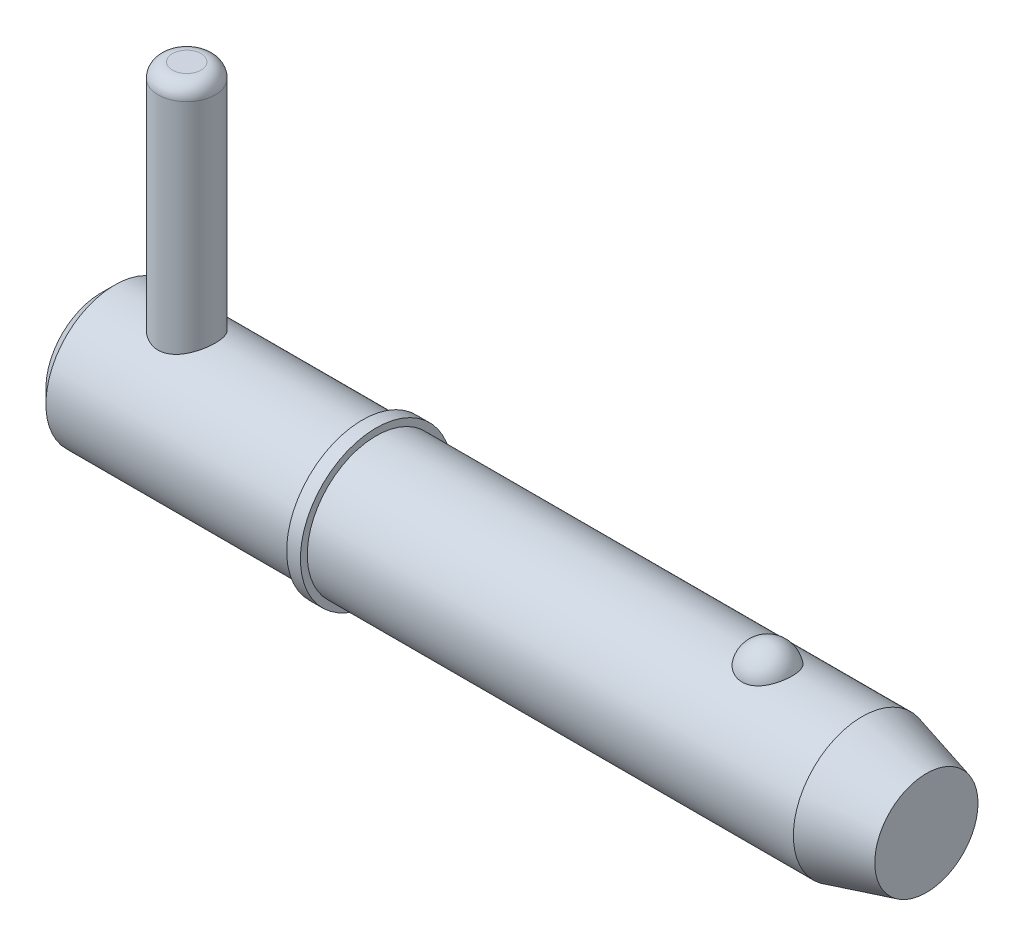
ISO-10303-21;
HEADER;
FILE_DESCRIPTION(('STEP AP214'),'2;1');
FILE_NAME('part.step','',(''),(''),'','','');
FILE_SCHEMA(('AUTOMOTIVE_DESIGN { 1 0 10303 214 1 1 1 1 }'));
ENDSEC;
DATA;
#1=APPLICATION_CONTEXT('core data for automotive mechanical design processes');
#2=APPLICATION_PROTOCOL_DEFINITION('international standard','automotive_design',2000,#1);
#3=PRODUCT_CONTEXT('',#1,'mechanical');
#4=PRODUCT('Part','Part','',(#3));
#5=PRODUCT_RELATED_PRODUCT_CATEGORY('part','',(#4));
#6=PRODUCT_DEFINITION_FORMATION('','',#4);
#7=PRODUCT_DEFINITION_CONTEXT('part definition',#1,'design');
#8=PRODUCT_DEFINITION('design','',#6,#7);
#9=PRODUCT_DEFINITION_SHAPE('','',#8);
#10=(LENGTH_UNIT() NAMED_UNIT(*) SI_UNIT(.MILLI.,.METRE.));
#11=(NAMED_UNIT(*) PLANE_ANGLE_UNIT() SI_UNIT($,.RADIAN.));
#12=(NAMED_UNIT(*) SI_UNIT($,.STERADIAN.) SOLID_ANGLE_UNIT());
#13=UNCERTAINTY_MEASURE_WITH_UNIT(LENGTH_MEASURE(1.E-05),#10,'distance_accuracy_value','');
#14=(GEOMETRIC_REPRESENTATION_CONTEXT(3) GLOBAL_UNCERTAINTY_ASSIGNED_CONTEXT((#13)) GLOBAL_UNIT_ASSIGNED_CONTEXT((#10,
#11,#12)) REPRESENTATION_CONTEXT('',''));
#15=CARTESIAN_POINT('',(0.,0.,0.));
#16=DIRECTION('',(0.,0.,1.));
#17=DIRECTION('',(1.,0.,0.));
#18=AXIS2_PLACEMENT_3D('',#15,#16,#17);
#19=CARTESIAN_POINT('',(5.94,20.635,0.));
#20=DIRECTION('',(0.,-1.,0.));
#21=DIRECTION('',(0.,0.,-1.));
#22=AXIS2_PLACEMENT_3D('',#19,#20,#21);
#23=CYLINDRICAL_SURFACE('',#22,1.98);
#24=CARTESIAN_POINT('',(5.94,-3.775,0.));
#25=DIRECTION('',(0.,1.,0.));
#26=DIRECTION('',(0.,0.,1.));
#27=AXIS2_PLACEMENT_3D('',#24,#25,#26);
#28=CIRCLE('',#27,1.98);
#29=CARTESIAN_POINT('',(5.94,-3.775,1.98));
#30=VERTEX_POINT('',#29);
#31=EDGE_CURVE('P0_E25',#30,#30,#28,.T.);
#32=ORIENTED_EDGE('',*,*,#31,.T.);
#33=EDGE_LOOP('',(#32));
#34=FACE_BOUND('',#33,.T.);
#35=CARTESIAN_POINT('',(5.94,19.645,0.));
#36=DIRECTION('',(0.,1.,0.));
#37=DIRECTION('',(0.,0.,1.));
#38=AXIS2_PLACEMENT_3D('',#35,#36,#37);
#39=CIRCLE('',#38,1.98);
#40=CARTESIAN_POINT('',(5.94,19.645,1.98));
#41=VERTEX_POINT('',#40);
#42=EDGE_CURVE('P0_E29',#41,#41,#39,.F.);
#43=ORIENTED_EDGE('',*,*,#42,.T.);
#44=EDGE_LOOP('',(#43));
#45=FACE_BOUND('',#44,.T.);
#46=ADVANCED_FACE('P0_F14',(#34,#45),#23,.T.);
#47=CARTESIAN_POINT('',(5.94,20.635,0.));
#48=DIRECTION('',(0.,1.,0.));
#49=DIRECTION('',(0.,0.,1.));
#50=AXIS2_PLACEMENT_3D('',#47,#48,#49);
#51=PLANE('',#50);
#52=CARTESIAN_POINT('',(5.94,20.635,0.));
#53=DIRECTION('',(0.,1.,0.));
#54=DIRECTION('',(0.,0.,1.));
#55=AXIS2_PLACEMENT_3D('',#52,#53,#54);
#56=CIRCLE('',#55,0.99);
#57=CARTESIAN_POINT('',(5.94,20.635,0.99));
#58=VERTEX_POINT('',#57);
#59=EDGE_CURVE('P0_E10',#58,#58,#56,.T.);
#60=ORIENTED_EDGE('',*,*,#59,.T.);
#61=EDGE_LOOP('',(#60));
#62=FACE_BOUND('',#61,.T.);
#63=ADVANCED_FACE('P0_F46',(#62),#51,.T.);
#64=CARTESIAN_POINT('',(5.94,-4.765,0.));
#65=DIRECTION('',(0.,1.,0.));
#66=DIRECTION('',(0.,0.,1.));
#67=AXIS2_PLACEMENT_3D('',#64,#65,#66);
#68=PLANE('',#67);
#69=CARTESIAN_POINT('',(5.94,-4.765,0.));
#70=DIRECTION('',(0.,1.,0.));
#71=DIRECTION('',(0.,0.,1.));
#72=AXIS2_PLACEMENT_3D('',#69,#70,#71);
#73=CIRCLE('',#72,0.99);
#74=CARTESIAN_POINT('',(5.94,-4.765,0.99));
#75=VERTEX_POINT('',#74);
#76=EDGE_CURVE('P0_E21',#75,#75,#73,.F.);
#77=ORIENTED_EDGE('',*,*,#76,.T.);
#78=EDGE_LOOP('',(#77));
#79=FACE_BOUND('',#78,.T.);
#80=ADVANCED_FACE('P0_F43',(#79),#68,.F.);
#81=CARTESIAN_POINT('',(5.94,-3.775,0.));
#82=DIRECTION('',(0.,1.,0.));
#83=DIRECTION('',(0.,0.,1.));
#84=AXIS2_PLACEMENT_3D('',#81,#82,#83);
#85=DEGENERATE_TOROIDAL_SURFACE('',#84,0.99,0.99,.T.);
#86=ORIENTED_EDGE('',*,*,#76,.F.);
#87=EDGE_LOOP('',(#86));
#88=FACE_BOUND('',#87,.T.);
#89=ORIENTED_EDGE('',*,*,#31,.F.);
#90=EDGE_LOOP('',(#89));
#91=FACE_BOUND('',#90,.T.);
#92=ADVANCED_FACE('P0_F38',(#88,#91),#85,.T.);
#93=CARTESIAN_POINT('',(5.94,19.645,0.));
#94=DIRECTION('',(0.,1.,0.));
#95=DIRECTION('',(0.,0.,1.));
#96=AXIS2_PLACEMENT_3D('',#93,#94,#95);
#97=DEGENERATE_TOROIDAL_SURFACE('',#96,0.99,0.99,.T.);
#98=ORIENTED_EDGE('',*,*,#42,.F.);
#99=EDGE_LOOP('',(#98));
#100=FACE_BOUND('',#99,.T.);
#101=ORIENTED_EDGE('',*,*,#59,.F.);
#102=EDGE_LOOP('',(#101));
#103=FACE_BOUND('',#102,.T.);
#104=ADVANCED_FACE('P0_F16',(#100,#103),#97,.T.);
#105=CLOSED_SHELL('',(#46,#63,#80,#92,#104));
#106=MANIFOLD_SOLID_BREP('P0_B1',#105);
#107=CARTESIAN_POINT('',(0.,0.,0.));
#108=DIRECTION('',(1.,0.,0.));
#109=DIRECTION('',(0.,0.,-1.));
#110=AXIS2_PLACEMENT_3D('',#107,#108,#109);
#111=CYLINDRICAL_SURFACE('',#110,4.765);
#112=CARTESIAN_POINT('',(52.7041944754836,0.,0.));
#113=DIRECTION('',(1.,0.,0.));
#114=DIRECTION('',(0.,0.,-1.));
#115=AXIS2_PLACEMENT_3D('',#112,#113,#114);
#116=CIRCLE('',#115,4.765);
#117=CARTESIAN_POINT('',(52.7041944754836,0.,-4.765));
#118=VERTEX_POINT('',#117);
#119=EDGE_CURVE('P1_E81',#118,#118,#116,.T.);
#120=ORIENTED_EDGE('',*,*,#119,.F.);
#121=EDGE_LOOP('',(#120));
#122=FACE_BOUND('',#121,.T.);
#123=CARTESIAN_POINT('',(19.05,0.,0.));
#124=DIRECTION('',(1.,0.,0.));
#125=DIRECTION('',(0.,0.,-1.));
#126=AXIS2_PLACEMENT_3D('',#123,#124,#125);
#127=CIRCLE('',#126,4.765);
#128=CARTESIAN_POINT('',(19.05,0.,-4.765));
#129=VERTEX_POINT('',#128);
#130=EDGE_CURVE('P1_E85',#129,#129,#127,.T.);
#131=ORIENTED_EDGE('',*,*,#130,.T.);
#132=EDGE_LOOP('',(#131));
#133=FACE_BOUND('',#132,.T.);
#134=CARTESIAN_POINT('',(46.151020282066,4.42764777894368,1.76101111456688));
#135=CARTESIAN_POINT('',(46.0597212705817,4.42764470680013,1.76101422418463));
#136=CARTESIAN_POINT('',(45.9684468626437,4.43059091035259,1.75366340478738));
#137=CARTESIAN_POINT('',(45.7886154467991,4.44201846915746,1.72451180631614));
#138=CARTESIAN_POINT('',(45.7000577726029,4.45049845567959,1.70271460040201));
#139=CARTESIAN_POINT('',(45.5282570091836,4.47200516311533,1.64539370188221));
#140=CARTESIAN_POINT('',(45.4450064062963,4.48502527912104,1.60988994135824));
#141=CARTESIAN_POINT('',(45.2857633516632,4.51419542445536,1.52617873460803));
#142=CARTESIAN_POINT('',(45.2097723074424,4.53034605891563,1.47796883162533));
#143=CARTESIAN_POINT('',(45.0647445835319,4.5645931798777,1.36860494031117));
#144=CARTESIAN_POINT('',(44.9959645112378,4.58273170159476,1.3071242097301));
#145=CARTESIAN_POINT('',(44.8693423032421,4.61870302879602,1.17370204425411));
#146=CARTESIAN_POINT('',(44.8115021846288,4.63653577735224,1.10175868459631));
#147=CARTESIAN_POINT('',(44.7055709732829,4.67090140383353,0.945806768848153));
#148=CARTESIAN_POINT('',(44.6580305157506,4.68734068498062,0.861402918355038));
#149=CARTESIAN_POINT('',(44.5770817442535,4.71628466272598,0.685442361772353));
#150=CARTESIAN_POINT('',(44.5436747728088,4.72878898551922,0.593884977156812));
#151=CARTESIAN_POINT('',(44.491287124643,4.74874061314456,0.404781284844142));
#152=CARTESIAN_POINT('',(44.4725178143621,4.75611366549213,0.307168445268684));
#153=CARTESIAN_POINT('',(44.4505846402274,4.76475393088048,0.109940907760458));
#154=CARTESIAN_POINT('',(44.4474205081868,4.76602124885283,0.0103262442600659));
#155=CARTESIAN_POINT('',(44.4567405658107,4.76232928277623,-0.187629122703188));
#156=CARTESIAN_POINT('',(44.4691588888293,4.7573962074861,-0.285973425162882));
#157=CARTESIAN_POINT('',(44.5092804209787,4.74184975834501,-0.479027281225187));
#158=CARTESIAN_POINT('',(44.5369839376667,4.7312362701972,-0.573736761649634));
#159=CARTESIAN_POINT('',(44.6071581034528,4.70540026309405,-0.756973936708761));
#160=CARTESIAN_POINT('',(44.6496460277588,4.69017235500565,-0.845494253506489));
#161=CARTESIAN_POINT('',(44.748520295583,4.6566986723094,-1.01378033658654));
#162=CARTESIAN_POINT('',(44.8049076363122,4.63845268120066,-1.09354547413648));
#163=CARTESIAN_POINT('',(44.930552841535,4.60085438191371,-1.24228523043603));
#164=CARTESIAN_POINT('',(44.9998439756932,4.58149930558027,-1.31123108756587));
#165=CARTESIAN_POINT('',(45.1496066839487,4.54391653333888,-1.43607409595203));
#166=CARTESIAN_POINT('',(45.2300771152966,4.52568872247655,-1.49197257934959));
#167=CARTESIAN_POINT('',(45.3981500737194,4.49293007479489,-1.58786764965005));
#168=CARTESIAN_POINT('',(45.4855445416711,4.47832346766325,-1.62820219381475));
#169=CARTESIAN_POINT('',(45.666553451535,4.45406011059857,-1.69345757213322));
#170=CARTESIAN_POINT('',(45.7601655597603,4.44440151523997,-1.71838415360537));
#171=CARTESIAN_POINT('',(45.9458939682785,4.43159888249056,-1.75112843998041));
#172=CARTESIAN_POINT('',(46.037849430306,4.42815213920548,-1.75974223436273));
#173=CARTESIAN_POINT('',(46.2219658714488,4.427247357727,-1.76201865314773));
#174=CARTESIAN_POINT('',(46.3141268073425,4.42978816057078,-1.7556841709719));
#175=CARTESIAN_POINT('',(46.4931292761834,4.4403864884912,-1.72869560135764));
#176=CARTESIAN_POINT('',(46.5800474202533,4.44827555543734,-1.70847853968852));
#177=CARTESIAN_POINT('',(46.7491314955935,4.46852246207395,-1.65479562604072));
#178=CARTESIAN_POINT('',(46.8312970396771,4.48088066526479,-1.62132869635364));
#179=CARTESIAN_POINT('',(46.9905916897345,4.50907357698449,-1.54120560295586));
#180=CARTESIAN_POINT('',(47.0675700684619,4.52497884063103,-1.49427526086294));
#181=CARTESIAN_POINT('',(47.2127080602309,4.55845148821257,-1.38881222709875));
#182=CARTESIAN_POINT('',(47.2808656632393,4.57601924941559,-1.33027689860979));
#183=CARTESIAN_POINT('',(47.4100990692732,4.61196537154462,-1.19991049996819));
#184=CARTESIAN_POINT('',(47.4706562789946,4.63034074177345,-1.12756415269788));
#185=CARTESIAN_POINT('',(47.5792797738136,4.66513959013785,-0.973612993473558));
#186=CARTESIAN_POINT('',(47.6273438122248,4.68156271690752,-0.892006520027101));
#187=CARTESIAN_POINT('',(47.711383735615,4.71130224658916,-0.718892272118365));
#188=CARTESIAN_POINT('',(47.7469185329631,4.724501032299,-0.627149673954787));
#189=CARTESIAN_POINT('',(47.8029522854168,4.74571823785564,-0.438611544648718));
#190=CARTESIAN_POINT('',(47.823450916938,4.75373654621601,-0.341815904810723));
#191=CARTESIAN_POINT('',(47.8490338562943,4.76378905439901,-0.145633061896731));
#192=CARTESIAN_POINT('',(47.854076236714,4.76580697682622,-0.0462395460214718));
#193=CARTESIAN_POINT('',(47.8485239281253,4.76360573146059,0.15203857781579));
#194=CARTESIAN_POINT('',(47.8379294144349,4.75938663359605,0.250923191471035));
#195=CARTESIAN_POINT('',(47.8013875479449,4.74516937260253,0.445004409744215));
#196=CARTESIAN_POINT('',(47.7754964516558,4.73519238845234,0.54021317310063));
#197=CARTESIAN_POINT('',(47.7089273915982,4.7104939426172,0.724662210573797));
#198=CARTESIAN_POINT('',(47.668248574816,4.69577220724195,0.813902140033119));
#199=CARTESIAN_POINT('',(47.5727177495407,4.66303767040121,0.984313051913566));
#200=CARTESIAN_POINT('',(47.5178042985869,4.64501070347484,1.06544688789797));
#201=CARTESIAN_POINT('',(47.3950496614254,4.60764678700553,1.21692673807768));
#202=CARTESIAN_POINT('',(47.3272086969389,4.58830985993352,1.2872729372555));
#203=CARTESIAN_POINT('',(47.1805480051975,4.55060370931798,1.41479271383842));
#204=CARTESIAN_POINT('',(47.1017918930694,4.53222967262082,1.47203785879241));
#205=CARTESIAN_POINT('',(46.9349890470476,4.49849576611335,1.57212016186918));
#206=CARTESIAN_POINT('',(46.8469417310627,4.48313608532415,1.61495641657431));
#207=CARTESIAN_POINT('',(46.6597918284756,4.45676184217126,1.68642657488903));
#208=CARTESIAN_POINT('',(46.5603653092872,4.44598302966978,1.71430590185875));
#209=CARTESIAN_POINT('',(46.3576210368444,4.43142918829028,1.7515925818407));
#210=CARTESIAN_POINT('',(46.2543049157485,4.42765125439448,1.76100759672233));
#211=CARTESIAN_POINT('',(46.151020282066,4.42764777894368,1.76101111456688));
#212=B_SPLINE_CURVE_WITH_KNOTS('',3,(#134,#135,#136,#137,#138,#139,#140,#141,#142,#143,#144,
#145,#146,#147,#148,#149,#150,#151,#152,#153,#154,#155,#156,#157,#158,#159,#160,#161,#162,#163,
#164,#165,#166,#167,#168,#169,#170,#171,#172,#173,#174,#175,#176,#177,#178,#179,#180,#181,#182,
#183,#184,#185,#186,#187,#188,#189,#190,#191,#192,#193,#194,#195,#196,#197,#198,#199,#200,#201,
#202,#203,#204,#205,#206,#207,#208,#209,#210,#211),.UNSPECIFIED.,.T.,.F.,(4,2,2,2,2,2,2,2,2,2,2,
2,2,2,2,2,2,2,2,2,2,2,2,2,2,2,2,2,2,2,2,2,2,2,2,2,2,2,4),(0.,0.273517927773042,
0.546968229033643,0.820022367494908,1.09312934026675,1.37393946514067,1.65480131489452,
1.94820420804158,2.24163496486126,2.53922817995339,2.8368162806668,3.13315071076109,
3.42949110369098,3.72617893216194,4.02288805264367,4.32037303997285,4.61782764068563,
4.90840095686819,5.19886582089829,5.4747485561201,5.75057789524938,6.01809977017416,
6.28564340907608,6.55907787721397,6.83257454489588,7.11962987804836,7.40673679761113,
7.70312663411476,7.99952284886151,8.29672237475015,8.59391856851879,8.89002850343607,
9.18615552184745,9.483582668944,9.78100471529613,10.0767610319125,10.3725358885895,
10.6820893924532,10.991514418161),.UNSPECIFIED.);
#213=CARTESIAN_POINT('',(46.151020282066,4.42764777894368,1.76101111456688));
#214=VERTEX_POINT('',#213);
#215=EDGE_CURVE('P1_E35',#214,#214,#212,.T.);
#216=ORIENTED_EDGE('',*,*,#215,.T.);
#217=EDGE_LOOP('',(#216));
#218=FACE_BOUND('',#217,.T.);
#219=ADVANCED_FACE('P1_F13',(#122,#133,#218),#111,.T.);
#220=CARTESIAN_POINT('',(0.,0.,0.));
#221=DIRECTION('',(-1.,0.,0.));
#222=DIRECTION('',(0.,0.,1.));
#223=AXIS2_PLACEMENT_3D('',#220,#221,#222);
#224=PLANE('',#223);
#225=CARTESIAN_POINT('',(0.,0.,0.));
#226=DIRECTION('',(1.,0.,0.));
#227=DIRECTION('',(0.,0.,-1.));
#228=AXIS2_PLACEMENT_3D('',#225,#226,#227);
#229=CIRCLE('',#228,3.812);
#230=CARTESIAN_POINT('',(0.,0.,-3.812));
#231=VERTEX_POINT('',#230);
#232=EDGE_CURVE('P1_E9',#231,#231,#229,.T.);
#233=ORIENTED_EDGE('',*,*,#232,.F.);
#234=EDGE_LOOP('',(#233));
#235=FACE_BOUND('',#234,.T.);
#236=ADVANCED_FACE('P1_F15',(#235),#224,.T.);
#237=CARTESIAN_POINT('',(0.952999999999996,0.,0.));
#238=DIRECTION('',(1.,0.,0.));
#239=DIRECTION('',(0.,0.,-1.));
#240=AXIS2_PLACEMENT_3D('',#237,#238,#239);
#241=CONICAL_SURFACE('',#240,4.765,0.78539816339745);
#242=ORIENTED_EDGE('',*,*,#232,.T.);
#243=EDGE_LOOP('',(#242));
#244=FACE_BOUND('',#243,.T.);
#245=CARTESIAN_POINT('',(0.952999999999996,0.,0.));
#246=DIRECTION('',(1.,0.,0.));
#247=DIRECTION('',(0.,0.,-1.));
#248=AXIS2_PLACEMENT_3D('',#245,#246,#247);
#249=CIRCLE('',#248,4.765);
#250=CARTESIAN_POINT('',(0.952999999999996,0.,-4.765));
#251=VERTEX_POINT('',#250);
#252=EDGE_CURVE('P1_E26',#251,#251,#249,.T.);
#253=ORIENTED_EDGE('',*,*,#252,.F.);
#254=EDGE_LOOP('',(#253));
#255=FACE_BOUND('',#254,.T.);
#256=ADVANCED_FACE('P1_F77',(#244,#255),#241,.T.);
#257=CARTESIAN_POINT('',(0.,0.,0.));
#258=DIRECTION('',(1.,0.,0.));
#259=DIRECTION('',(0.,0.,-1.));
#260=AXIS2_PLACEMENT_3D('',#257,#258,#259);
#261=CYLINDRICAL_SURFACE('',#260,4.765);
#262=CARTESIAN_POINT('',(5.94,-4.33414639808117,1.98));
#263=CARTESIAN_POINT('',(5.83435484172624,-4.33415447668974,1.97999169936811));
#264=CARTESIAN_POINT('',(5.72854887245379,-4.33806396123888,1.97149330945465));
#265=CARTESIAN_POINT('',(5.51998191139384,-4.35319906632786,1.93783487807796));
#266=CARTESIAN_POINT('',(5.41723000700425,-4.3644446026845,1.91262947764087));
#267=CARTESIAN_POINT('',(5.21817294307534,-4.39274225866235,1.84670269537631));
#268=CARTESIAN_POINT('',(5.12184344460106,-4.40977076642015,1.80604432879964));
#269=CARTESIAN_POINT('',(4.93740039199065,-4.44768106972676,1.71055160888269));
#270=CARTESIAN_POINT('',(4.84928487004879,-4.46856193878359,1.65572066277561));
#271=CARTESIAN_POINT('',(4.67826533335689,-4.51326966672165,1.52981120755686));
#272=CARTESIAN_POINT('',(4.59593118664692,-4.53719608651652,1.45799365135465));
#273=CARTESIAN_POINT('',(4.44405452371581,-4.58448035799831,1.30170177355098));
#274=CARTESIAN_POINT('',(4.37451692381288,-4.60783798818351,1.21722260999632));
#275=CARTESIAN_POINT('',(4.24730683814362,-4.65256187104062,1.03353484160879));
#276=CARTESIAN_POINT('',(4.19027484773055,-4.67379892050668,0.933848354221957));
#277=CARTESIAN_POINT('',(4.0940363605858,-4.7106711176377,0.7252544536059));
#278=CARTESIAN_POINT('',(4.05482199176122,-4.72630873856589,0.61635113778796));
#279=CARTESIAN_POINT('',(3.99739515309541,-4.74951416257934,0.398397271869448));
#280=CARTESIAN_POINT('',(3.97820018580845,-4.7574579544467,0.289646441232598));
#281=CARTESIAN_POINT('',(3.95818309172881,-4.76574596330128,0.0701967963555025));
#282=CARTESIAN_POINT('',(3.95735355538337,-4.76609324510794,-0.0405012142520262));
#283=CARTESIAN_POINT('',(3.9735743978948,-4.75937098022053,-0.253561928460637));
#284=CARTESIAN_POINT('',(3.98954548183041,-4.75274912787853,-0.356023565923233));
#285=CARTESIAN_POINT('',(4.03706504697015,-4.73344665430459,-0.556659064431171));
#286=CARTESIAN_POINT('',(4.06861467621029,-4.72076558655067,-0.654832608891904));
#287=CARTESIAN_POINT('',(4.14677192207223,-4.69032846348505,-0.845904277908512));
#288=CARTESIAN_POINT('',(4.19360181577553,-4.67249797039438,-0.938699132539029));
#289=CARTESIAN_POINT('',(4.30077315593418,-4.63350852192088,-1.11535616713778));
#290=CARTESIAN_POINT('',(4.3611193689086,-4.61234839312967,-1.19921518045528));
#291=CARTESIAN_POINT('',(4.49853487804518,-4.56707259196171,-1.3618711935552));
#292=CARTESIAN_POINT('',(4.57648039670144,-4.5428537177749,-1.43990029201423));
#293=CARTESIAN_POINT('',(4.74440779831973,-4.49530722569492,-1.58211009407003));
#294=CARTESIAN_POINT('',(4.83439425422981,-4.47197995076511,-1.64628551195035));
#295=CARTESIAN_POINT('',(5.02755026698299,-4.42812342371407,-1.76092221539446));
#296=CARTESIAN_POINT('',(5.13105348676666,-4.40770990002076,-1.81086937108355));
#297=CARTESIAN_POINT('',(5.34607555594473,-4.37336901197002,-1.89231211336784));
#298=CARTESIAN_POINT('',(5.45758864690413,-4.3594370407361,-1.92382080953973));
#299=CARTESIAN_POINT('',(5.67777275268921,-4.34077746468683,-1.96554536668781));
#300=CARTESIAN_POINT('',(5.78616167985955,-4.33551319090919,-1.9770057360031));
#301=CARTESIAN_POINT('',(6.00341835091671,-4.33325118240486,-1.98196183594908));
#302=CARTESIAN_POINT('',(6.11228591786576,-4.33625061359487,-1.97546372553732));
#303=CARTESIAN_POINT('',(6.32012423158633,-4.34962383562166,-1.94582288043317));
#304=CARTESIAN_POINT('',(6.41928436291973,-4.35951709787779,-1.92376364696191));
#305=CARTESIAN_POINT('',(6.61241543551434,-4.38495043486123,-1.86506038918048));
#306=CARTESIAN_POINT('',(6.70638516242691,-4.40049182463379,-1.82841296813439));
#307=CARTESIAN_POINT('',(6.89090272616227,-4.43627016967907,-1.73985559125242));
#308=CARTESIAN_POINT('',(6.98113841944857,-4.45667771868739,-1.68736639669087));
#309=CARTESIAN_POINT('',(7.1519532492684,-4.49964530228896,-1.56919282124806));
#310=CARTESIAN_POINT('',(7.232528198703,-4.52220626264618,-1.50350275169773));
#311=CARTESIAN_POINT('',(7.38851617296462,-4.56914071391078,-1.35452895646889));
#312=CARTESIAN_POINT('',(7.46298462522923,-4.5935132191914,-1.27025197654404));
#313=CARTESIAN_POINT('',(7.59689029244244,-4.63962841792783,-1.08983181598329));
#314=CARTESIAN_POINT('',(7.65632644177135,-4.66137092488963,-0.993687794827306));
#315=CARTESIAN_POINT('',(7.75840361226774,-4.69991192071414,-0.791608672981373));
#316=CARTESIAN_POINT('',(7.80100481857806,-4.71669866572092,-0.685651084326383));
#317=CARTESIAN_POINT('',(7.86746997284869,-4.74331408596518,-0.467197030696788));
#318=CARTESIAN_POINT('',(7.8913450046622,-4.75314687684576,-0.354704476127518));
#319=CARTESIAN_POINT('',(7.91828971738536,-4.76427543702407,-0.134819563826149));
#320=CARTESIAN_POINT('',(7.92269147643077,-4.76611762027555,-0.027616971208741));
#321=CARTESIAN_POINT('',(7.91414154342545,-4.76256684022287,0.185959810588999));
#322=CARTESIAN_POINT('',(7.90119286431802,-4.75717513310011,0.292334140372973));
#323=CARTESIAN_POINT('',(7.85926572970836,-4.74004856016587,0.497383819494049));
#324=CARTESIAN_POINT('',(7.83086647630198,-4.72854322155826,0.596198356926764));
#325=CARTESIAN_POINT('',(7.75947503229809,-4.70045111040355,0.787624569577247));
#326=CARTESIAN_POINT('',(7.71648006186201,-4.68386336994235,0.880235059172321));
#327=CARTESIAN_POINT('',(7.6149456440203,-4.64628321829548,1.06122875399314));
#328=CARTESIAN_POINT('',(7.55579211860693,-4.62512577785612,1.14923242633));
#329=CARTESIAN_POINT('',(7.42451813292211,-4.58091700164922,1.31443888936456));
#330=CARTESIAN_POINT('',(7.35239289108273,-4.5578649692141,1.39163767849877));
#331=CARTESIAN_POINT('',(7.19146107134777,-4.51050832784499,1.53847013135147));
#332=CARTESIAN_POINT('',(7.10185635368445,-4.48622440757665,1.60723941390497));
#333=CARTESIAN_POINT('',(6.91164948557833,-4.44076541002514,1.72888900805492));
#334=CARTESIAN_POINT('',(6.81104124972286,-4.41959206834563,1.78176046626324));
#335=CARTESIAN_POINT('',(6.60181953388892,-4.38318936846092,1.86953227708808));
#336=CARTESIAN_POINT('',(6.49325511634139,-4.3679267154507,1.90453365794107));
#337=CARTESIAN_POINT('',(6.32681512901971,-4.35102038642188,1.94268459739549));
#338=CARTESIAN_POINT('',(6.27079191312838,-4.34638447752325,1.953006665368));
#339=CARTESIAN_POINT('',(6.15793999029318,-4.33925923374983,1.96879053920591));
#340=CARTESIAN_POINT('',(6.10111188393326,-4.33676837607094,1.97425579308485));
#341=CARTESIAN_POINT('',(6.00947316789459,-4.33456308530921,1.97908711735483));
#342=CARTESIAN_POINT('',(5.97474528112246,-4.33414374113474,1.98000272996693));
#343=CARTESIAN_POINT('',(5.94,-4.33414639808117,1.98));
#344=B_SPLINE_CURVE_WITH_KNOTS('',3,(#262,#263,#264,#265,#266,#267,#268,#269,#270,#271,#272,
#273,#274,#275,#276,#277,#278,#279,#280,#281,#282,#283,#284,#285,#286,#287,#288,#289,#290,#291,
#292,#293,#294,#295,#296,#297,#298,#299,#300,#301,#302,#303,#304,#305,#306,#307,#308,#309,#310,
#311,#312,#313,#314,#315,#316,#317,#318,#319,#320,#321,#322,#323,#324,#325,#326,#327,#328,#329,
#330,#331,#332,#333,#334,#335,#336,#337,#338,#339,#340,#341,#342,#343),.UNSPECIFIED.,.T.,.F.,(4,
2,2,2,2,2,2,2,2,2,2,2,2,2,2,2,2,2,2,2,2,2,2,2,2,2,2,2,2,2,2,2,2,2,2,2,2,2,2,2,4),(0.,
0.316814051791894,0.634491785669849,0.950887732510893,1.2672076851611,1.60127705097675,
1.93547449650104,2.28407463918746,2.63252061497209,2.96292077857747,3.29318763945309,
3.60346227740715,3.91375978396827,4.22878888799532,4.54392926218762,4.88117914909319,
5.21855748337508,5.56691259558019,5.91501972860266,6.24062939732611,6.56612741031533,
6.87094948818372,7.17584258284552,7.49361276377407,7.81152017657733,8.15513975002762,
8.4987836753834,8.8432355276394,9.18748334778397,9.50777781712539,9.8280166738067,
10.1370037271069,10.4460496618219,10.7690461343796,11.0921619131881,11.4371238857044,
11.7822776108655,12.1254577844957,12.2967183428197,12.4678572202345,12.5720531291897),.UNSPECIFIED.);
#345=CARTESIAN_POINT('',(5.94,-4.33414639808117,1.98));
#346=VERTEX_POINT('',#345);
#347=EDGE_CURVE('P1_E17',#346,#346,#344,.T.);
#348=ORIENTED_EDGE('',*,*,#347,.F.);
#349=EDGE_LOOP('',(#348));
#350=FACE_BOUND('',#349,.T.);
#351=CARTESIAN_POINT('',(5.94,4.33414639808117,1.98));
#352=CARTESIAN_POINT('',(6.04564515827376,4.33415447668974,1.97999169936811));
#353=CARTESIAN_POINT('',(6.15145112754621,4.33806396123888,1.97149330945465));
#354=CARTESIAN_POINT('',(6.36001808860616,4.35319906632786,1.93783487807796));
#355=CARTESIAN_POINT('',(6.46276999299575,4.3644446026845,1.91262947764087));
#356=CARTESIAN_POINT('',(6.66182705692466,4.39274225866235,1.84670269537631));
#357=CARTESIAN_POINT('',(6.75815655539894,4.40977076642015,1.80604432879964));
#358=CARTESIAN_POINT('',(6.94259960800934,4.44768106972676,1.71055160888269));
#359=CARTESIAN_POINT('',(7.03071512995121,4.46856193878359,1.65572066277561));
#360=CARTESIAN_POINT('',(7.20173466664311,4.51326966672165,1.52981120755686));
#361=CARTESIAN_POINT('',(7.28406881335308,4.53719608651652,1.45799365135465));
#362=CARTESIAN_POINT('',(7.43594547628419,4.58448035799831,1.30170177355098));
#363=CARTESIAN_POINT('',(7.50548307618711,4.60783798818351,1.21722260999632));
#364=CARTESIAN_POINT('',(7.63269316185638,4.65256187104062,1.03353484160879));
#365=CARTESIAN_POINT('',(7.68972515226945,4.67379892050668,0.933848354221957));
#366=CARTESIAN_POINT('',(7.7859636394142,4.7106711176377,0.7252544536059));
#367=CARTESIAN_POINT('',(7.82517800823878,4.72630873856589,0.61635113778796));
#368=CARTESIAN_POINT('',(7.88260484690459,4.74951416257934,0.398397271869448));
#369=CARTESIAN_POINT('',(7.90179981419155,4.7574579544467,0.289646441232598));
#370=CARTESIAN_POINT('',(7.92181690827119,4.76574596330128,0.0701967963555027));
#371=CARTESIAN_POINT('',(7.92264644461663,4.76609324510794,-0.040501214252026));
#372=CARTESIAN_POINT('',(7.9064256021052,4.75937098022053,-0.253561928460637));
#373=CARTESIAN_POINT('',(7.89045451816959,4.75274912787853,-0.356023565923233));
#374=CARTESIAN_POINT('',(7.84293495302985,4.73344665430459,-0.55665906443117));
#375=CARTESIAN_POINT('',(7.81138532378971,4.72076558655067,-0.654832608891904));
#376=CARTESIAN_POINT('',(7.73322807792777,4.69032846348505,-0.845904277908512));
#377=CARTESIAN_POINT('',(7.68639818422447,4.67249797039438,-0.938699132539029));
#378=CARTESIAN_POINT('',(7.57922684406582,4.63350852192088,-1.11535616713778));
#379=CARTESIAN_POINT('',(7.5188806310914,4.61234839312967,-1.19921518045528));
#380=CARTESIAN_POINT('',(7.38146512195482,4.56707259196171,-1.3618711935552));
#381=CARTESIAN_POINT('',(7.30351960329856,4.5428537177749,-1.43990029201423));
#382=CARTESIAN_POINT('',(7.13559220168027,4.49530722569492,-1.58211009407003));
#383=CARTESIAN_POINT('',(7.04560574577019,4.47197995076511,-1.64628551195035));
#384=CARTESIAN_POINT('',(6.85244973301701,4.42812342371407,-1.76092221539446));
#385=CARTESIAN_POINT('',(6.74894651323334,4.40770990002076,-1.81086937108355));
#386=CARTESIAN_POINT('',(6.53392444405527,4.37336901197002,-1.89231211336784));
#387=CARTESIAN_POINT('',(6.42241135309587,4.3594370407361,-1.92382080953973));
#388=CARTESIAN_POINT('',(6.20222724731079,4.34077746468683,-1.96554536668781));
#389=CARTESIAN_POINT('',(6.09383832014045,4.33551319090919,-1.9770057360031));
#390=CARTESIAN_POINT('',(5.87658164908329,4.33325118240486,-1.98196183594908));
#391=CARTESIAN_POINT('',(5.76771408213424,4.33625061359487,-1.97546372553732));
#392=CARTESIAN_POINT('',(5.55987576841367,4.34962383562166,-1.94582288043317));
#393=CARTESIAN_POINT('',(5.46071563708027,4.35951709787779,-1.92376364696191));
#394=CARTESIAN_POINT('',(5.26758456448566,4.38495043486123,-1.86506038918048));
#395=CARTESIAN_POINT('',(5.17361483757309,4.40049182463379,-1.82841296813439));
#396=CARTESIAN_POINT('',(4.98909727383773,4.43627016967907,-1.73985559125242));
#397=CARTESIAN_POINT('',(4.89886158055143,4.45667771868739,-1.68736639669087));
#398=CARTESIAN_POINT('',(4.72804675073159,4.49964530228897,-1.56919282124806));
#399=CARTESIAN_POINT('',(4.647471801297,4.52220626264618,-1.50350275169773));
#400=CARTESIAN_POINT('',(4.49148382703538,4.56914071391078,-1.35452895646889));
#401=CARTESIAN_POINT('',(4.41701537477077,4.5935132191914,-1.27025197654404));
#402=CARTESIAN_POINT('',(4.28310970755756,4.63962841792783,-1.08983181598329));
#403=CARTESIAN_POINT('',(4.22367355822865,4.66137092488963,-0.993687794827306));
#404=CARTESIAN_POINT('',(4.12159638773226,4.69991192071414,-0.791608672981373));
#405=CARTESIAN_POINT('',(4.07899518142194,4.71669866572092,-0.685651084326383));
#406=CARTESIAN_POINT('',(4.01253002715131,4.74331408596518,-0.467197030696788));
#407=CARTESIAN_POINT('',(3.98865499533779,4.75314687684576,-0.354704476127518));
#408=CARTESIAN_POINT('',(3.96171028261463,4.76427543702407,-0.134819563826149));
#409=CARTESIAN_POINT('',(3.95730852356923,4.76611762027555,-0.0276169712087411));
#410=CARTESIAN_POINT('',(3.96585845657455,4.76256684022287,0.185959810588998));
#411=CARTESIAN_POINT('',(3.97880713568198,4.75717513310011,0.292334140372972));
#412=CARTESIAN_POINT('',(4.02073427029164,4.74004856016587,0.497383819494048));
#413=CARTESIAN_POINT('',(4.04913352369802,4.72854322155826,0.596198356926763));
#414=CARTESIAN_POINT('',(4.12052496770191,4.70045111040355,0.787624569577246));
#415=CARTESIAN_POINT('',(4.16351993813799,4.68386336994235,0.880235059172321));
#416=CARTESIAN_POINT('',(4.2650543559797,4.64628321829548,1.06122875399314));
#417=CARTESIAN_POINT('',(4.32420788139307,4.62512577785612,1.14923242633));
#418=CARTESIAN_POINT('',(4.45548186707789,4.58091700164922,1.31443888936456));
#419=CARTESIAN_POINT('',(4.52760710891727,4.5578649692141,1.39163767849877));
#420=CARTESIAN_POINT('',(4.68853892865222,4.51050832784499,1.53847013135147));
#421=CARTESIAN_POINT('',(4.77814364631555,4.48622440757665,1.60723941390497));
#422=CARTESIAN_POINT('',(4.96835051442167,4.44076541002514,1.72888900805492));
#423=CARTESIAN_POINT('',(5.06895875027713,4.41959206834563,1.78176046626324));
#424=CARTESIAN_POINT('',(5.27818046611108,4.38318936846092,1.86953227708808));
#425=CARTESIAN_POINT('',(5.38674488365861,4.3679267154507,1.90453365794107));
#426=CARTESIAN_POINT('',(5.55318487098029,4.35102038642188,1.94268459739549));
#427=CARTESIAN_POINT('',(5.60920808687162,4.34638447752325,1.953006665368));
#428=CARTESIAN_POINT('',(5.72206000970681,4.33925923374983,1.96879053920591));
#429=CARTESIAN_POINT('',(5.77888811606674,4.33676837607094,1.97425579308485));
#430=CARTESIAN_POINT('',(5.87052683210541,4.33456308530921,1.97908711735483));
#431=CARTESIAN_POINT('',(5.90525471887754,4.33414374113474,1.98000272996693));
#432=CARTESIAN_POINT('',(5.94,4.33414639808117,1.98));
#433=B_SPLINE_CURVE_WITH_KNOTS('',3,(#351,#352,#353,#354,#355,#356,#357,#358,#359,#360,#361,
#362,#363,#364,#365,#366,#367,#368,#369,#370,#371,#372,#373,#374,#375,#376,#377,#378,#379,#380,
#381,#382,#383,#384,#385,#386,#387,#388,#389,#390,#391,#392,#393,#394,#395,#396,#397,#398,#399,
#400,#401,#402,#403,#404,#405,#406,#407,#408,#409,#410,#411,#412,#413,#414,#415,#416,#417,#418,
#419,#420,#421,#422,#423,#424,#425,#426,#427,#428,#429,#430,#431,#432),.UNSPECIFIED.,.T.,.F.,(4,
2,2,2,2,2,2,2,2,2,2,2,2,2,2,2,2,2,2,2,2,2,2,2,2,2,2,2,2,2,2,2,2,2,2,2,2,2,2,2,4),(0.,
0.316814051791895,0.634491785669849,0.950887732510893,1.2672076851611,1.60127705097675,
1.93547449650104,2.28407463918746,2.63252061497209,2.96292077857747,3.29318763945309,
3.60346227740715,3.91375978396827,4.22878888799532,4.54392926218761,4.88117914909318,
5.21855748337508,5.56691259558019,5.91501972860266,6.24062939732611,6.56612741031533,
6.87094948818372,7.17584258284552,7.49361276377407,7.81152017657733,8.15513975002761,
8.4987836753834,8.84323552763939,9.18748334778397,9.50777781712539,9.8280166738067,
10.1370037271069,10.4460496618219,10.7690461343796,11.0921619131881,11.4371238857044,
11.7822776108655,12.1254577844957,12.2967183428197,12.4678572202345,12.5720531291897),.UNSPECIFIED.);
#434=CARTESIAN_POINT('',(5.94,4.33414639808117,1.98));
#435=VERTEX_POINT('',#434);
#436=EDGE_CURVE('P1_E43',#435,#435,#433,.T.);
#437=ORIENTED_EDGE('',*,*,#436,.F.);
#438=EDGE_LOOP('',(#437));
#439=FACE_BOUND('',#438,.T.);
#440=ORIENTED_EDGE('',*,*,#252,.T.);
#441=EDGE_LOOP('',(#440));
#442=FACE_BOUND('',#441,.T.);
#443=CARTESIAN_POINT('',(18.097,0.,0.));
#444=DIRECTION('',(1.,0.,0.));
#445=DIRECTION('',(0.,0.,-1.));
#446=AXIS2_PLACEMENT_3D('',#443,#444,#445);
#447=CIRCLE('',#446,4.765);
#448=CARTESIAN_POINT('',(18.097,0.,-4.765));
#449=VERTEX_POINT('',#448);
#450=EDGE_CURVE('P1_E31',#449,#449,#447,.T.);
#451=ORIENTED_EDGE('',*,*,#450,.F.);
#452=EDGE_LOOP('',(#451));
#453=FACE_BOUND('',#452,.T.);
#454=ADVANCED_FACE('P1_F103',(#350,#439,#442,#453),#261,.T.);
#455=CARTESIAN_POINT('',(18.097,4.765,0.));
#456=DIRECTION('',(-1.,0.,0.));
#457=DIRECTION('',(0.,0.,1.));
#458=AXIS2_PLACEMENT_3D('',#455,#456,#457);
#459=PLANE('',#458);
#460=ORIENTED_EDGE('',*,*,#450,.T.);
#461=EDGE_LOOP('',(#460));
#462=FACE_BOUND('',#461,.T.);
#463=CARTESIAN_POINT('',(18.097,0.,0.));
#464=DIRECTION('',(1.,0.,0.));
#465=DIRECTION('',(0.,0.,-1.));
#466=AXIS2_PLACEMENT_3D('',#463,#464,#465);
#467=CIRCLE('',#466,5.2415);
#468=CARTESIAN_POINT('',(18.097,0.,-5.2415));
#469=VERTEX_POINT('',#468);
#470=EDGE_CURVE('P1_E91',#469,#469,#467,.T.);
#471=ORIENTED_EDGE('',*,*,#470,.F.);
#472=EDGE_LOOP('',(#471));
#473=FACE_BOUND('',#472,.T.);
#474=ADVANCED_FACE('P1_F100',(#462,#473),#459,.T.);
#475=CARTESIAN_POINT('',(0.,0.,0.));
#476=DIRECTION('',(1.,0.,0.));
#477=DIRECTION('',(0.,0.,-1.));
#478=AXIS2_PLACEMENT_3D('',#475,#476,#477);
#479=CYLINDRICAL_SURFACE('',#478,5.2415);
#480=ORIENTED_EDGE('',*,*,#470,.T.);
#481=EDGE_LOOP('',(#480));
#482=FACE_BOUND('',#481,.T.);
#483=CARTESIAN_POINT('',(19.05,0.,0.));
#484=DIRECTION('',(1.,0.,0.));
#485=DIRECTION('',(0.,0.,-1.));
#486=AXIS2_PLACEMENT_3D('',#483,#484,#485);
#487=CIRCLE('',#486,5.2415);
#488=CARTESIAN_POINT('',(19.05,0.,-5.2415));
#489=VERTEX_POINT('',#488);
#490=EDGE_CURVE('P1_E88',#489,#489,#487,.T.);
#491=ORIENTED_EDGE('',*,*,#490,.F.);
#492=EDGE_LOOP('',(#491));
#493=FACE_BOUND('',#492,.T.);
#494=ADVANCED_FACE('P1_F68',(#482,#493),#479,.T.);
#495=CARTESIAN_POINT('',(19.05,5.2415,0.));
#496=DIRECTION('',(1.,0.,0.));
#497=DIRECTION('',(0.,0.,-1.));
#498=AXIS2_PLACEMENT_3D('',#495,#496,#497);
#499=PLANE('',#498);
#500=ORIENTED_EDGE('',*,*,#490,.T.);
#501=EDGE_LOOP('',(#500));
#502=FACE_BOUND('',#501,.T.);
#503=ORIENTED_EDGE('',*,*,#130,.F.);
#504=EDGE_LOOP('',(#503));
#505=FACE_BOUND('',#504,.T.);
#506=ADVANCED_FACE('P1_F62',(#502,#505),#499,.T.);
#507=CARTESIAN_POINT('',(57.15,0.,0.));
#508=DIRECTION('',(-1.,0.,0.));
#509=DIRECTION('',(0.,0.,1.));
#510=AXIS2_PLACEMENT_3D('',#507,#508,#509);
#511=CONICAL_SURFACE('',#510,3.57375000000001,0.26179938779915);
#512=ORIENTED_EDGE('',*,*,#119,.T.);
#513=EDGE_LOOP('',(#512));
#514=FACE_BOUND('',#513,.T.);
#515=CARTESIAN_POINT('',(57.15,0.,0.));
#516=DIRECTION('',(1.,0.,0.));
#517=DIRECTION('',(0.,0.,-1.));
#518=AXIS2_PLACEMENT_3D('',#515,#516,#517);
#519=CIRCLE('',#518,3.57375000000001);
#520=CARTESIAN_POINT('',(57.15,0.,-3.57375000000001));
#521=VERTEX_POINT('',#520);
#522=EDGE_CURVE('P1_E42',#521,#521,#519,.T.);
#523=ORIENTED_EDGE('',*,*,#522,.F.);
#524=EDGE_LOOP('',(#523));
#525=FACE_BOUND('',#524,.T.);
#526=ADVANCED_FACE('P1_F59',(#514,#525),#511,.T.);
#527=CARTESIAN_POINT('',(57.15,3.57375000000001,0.));
#528=DIRECTION('',(1.,0.,0.));
#529=DIRECTION('',(0.,0.,-1.));
#530=AXIS2_PLACEMENT_3D('',#527,#528,#529);
#531=PLANE('',#530);
#532=ORIENTED_EDGE('',*,*,#522,.T.);
#533=EDGE_LOOP('',(#532));
#534=FACE_BOUND('',#533,.T.);
#535=ADVANCED_FACE('P1_F55',(#534),#531,.T.);
#536=CARTESIAN_POINT('',(46.151020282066,4.2885,0.));
#537=DIRECTION('',(-1.,0.,0.));
#538=DIRECTION('',(0.,1.,0.));
#539=AXIS2_PLACEMENT_3D('',#536,#537,#538);
#540=SPHERICAL_SURFACE('',#539,1.7665);
#541=ORIENTED_EDGE('',*,*,#215,.F.);
#542=EDGE_LOOP('',(#541));
#543=FACE_BOUND('',#542,.T.);
#544=ADVANCED_FACE('P1_F50',(#543),#540,.T.);
#545=CARTESIAN_POINT('',(5.94,-5.2415,0.));
#546=DIRECTION('',(0.,1.,0.));
#547=DIRECTION('',(0.,0.,1.));
#548=AXIS2_PLACEMENT_3D('',#545,#546,#547);
#549=CYLINDRICAL_SURFACE('',#548,1.98);
#550=ORIENTED_EDGE('',*,*,#347,.T.);
#551=EDGE_LOOP('',(#550));
#552=FACE_BOUND('',#551,.T.);
#553=ORIENTED_EDGE('',*,*,#436,.T.);
#554=EDGE_LOOP('',(#553));
#555=FACE_BOUND('',#554,.T.);
#556=ADVANCED_FACE('P1_F54',(#552,#555),#549,.F.);
#557=CLOSED_SHELL('',(#219,#236,#256,#454,#474,#494,#506,#526,#535,#544,#556));
#558=MANIFOLD_SOLID_BREP('P1_B1',#557);
#559=ADVANCED_BREP_SHAPE_REPRESENTATION('',(#18,#106,#558),#14);
#560=SHAPE_DEFINITION_REPRESENTATION(#9,#559);
ENDSEC;
END-ISO-10303-21;
